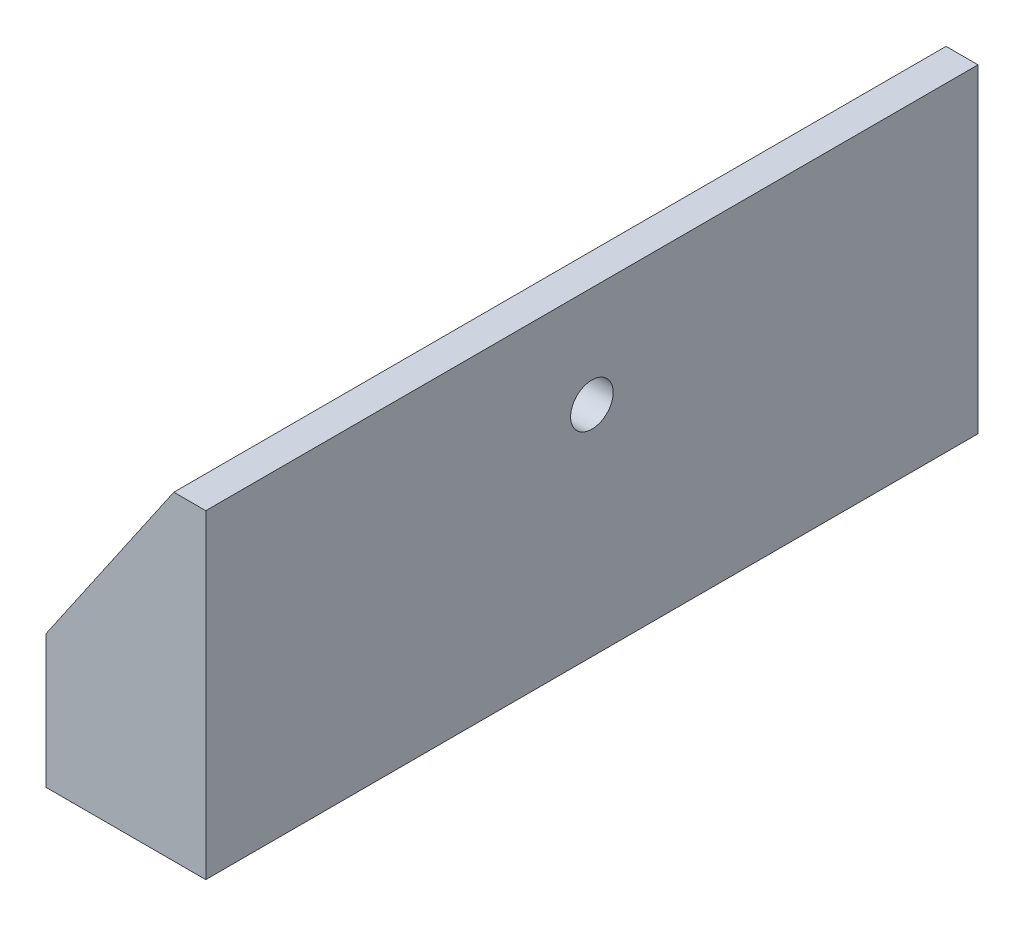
from build123d import *

# Parameters (mm, degrees)
BOSS_EXTRU_1_DEPTH      = 72.5
ESQUISSE2_R             = 2
ENL_V_MAT_EXTRU_1_DEPTH = 43.000744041


with BuildPart() as part:
    # Esquisse1 → Boss.-Extru.1 (new body)
    with BuildSketch(Plane.XY.offset(36.25)):
        Polygon((7.5, -15), (7.5, 15), (4.5, 15), (-7.5, -2.5), (-7.5, -15), align=None)
    extrude(amount=-BOSS_EXTRU_1_DEPTH)

    # Esquisse2 → Enl_v. mat.-Extru.1 (cut, through all)
    with BuildSketch(Plane(origin=(7.5, 0, 0), x_dir=(0, 0, -1), z_dir=(1, 0, 0))):
        with Locations((0, 5.5)):
            Circle(ESQUISSE2_R)
    extrude(amount=-ENL_V_MAT_EXTRU_1_DEPTH, mode=Mode.SUBTRACT)


solid = part.part
